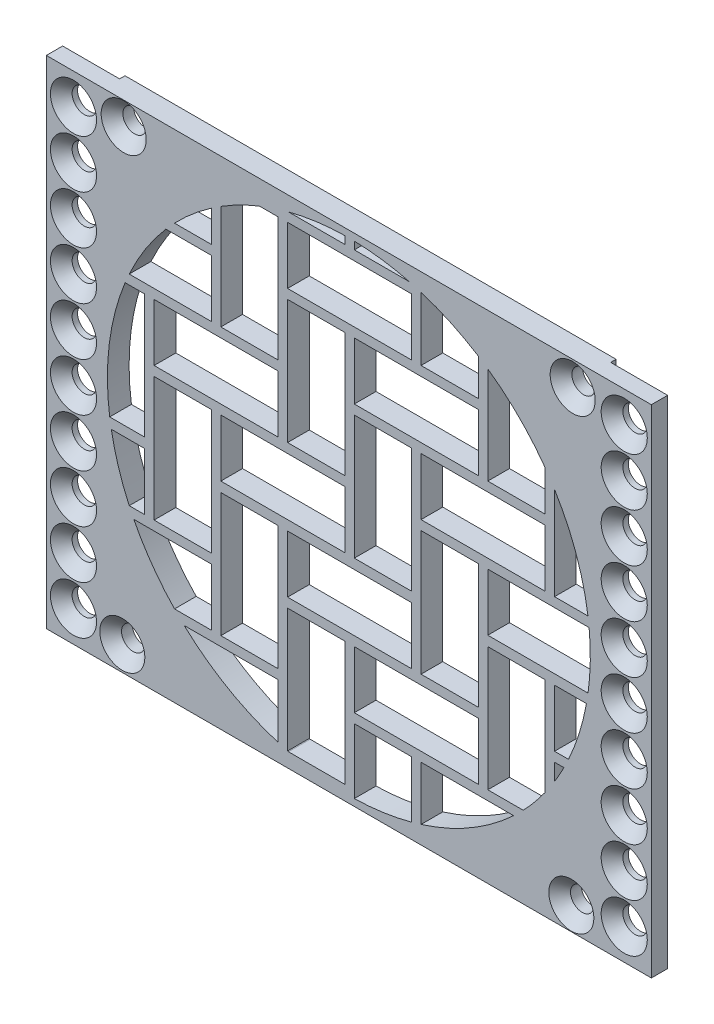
from build123d import *

# Parameters (mm, degrees)
SKETCH1_W           = 111.5
SKETCH1_H           = 91.5
SKETCH1_R           = 2.15
SKETCH1_R_2         = 44.5
SKETCH1_R_3         = 2.25
BOSS_EXTRUDE1_DEPTH = 4
SKETCH2_W           = 10.55131
SKETCH2_H           = 22.92178
SKETCH2_W_2         = 22.85108
SKETCH2_H_2         = 10.55145
SKETCH2_W_3         = 22.85101
SKETCH2_H_3         = 22.85094
SKETCH2_W_4         = 10.55145
SKETCH2_H_4         = 22.85122
SKETCH2_H_5         = 10.55117
BOSS_EXTRUDE2_DEPTH = 4
SKETCH3_W           = 10.5
SKETCH3_H           = 91.5
CUT_EXTRUDE1_DEPTH  = 1
CHAMFER1_SIZE       = 2


with BuildPart() as part:
    # Sketch1 → Boss-Extrude1 (new body)
    with BuildSketch(Plane.XY):
        with Locations((-1.831147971, 0)):
            Rectangle(SKETCH1_W, SKETCH1_H)
        with Locations((39.418852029, 41.25)):
            Circle(SKETCH1_R, mode=Mode.SUBTRACT)
        with Locations((39.168852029, -41.5)):
            Circle(SKETCH1_R, mode=Mode.SUBTRACT)
        with Locations((-43.581147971, -41.25)):
            Circle(SKETCH1_R, mode=Mode.SUBTRACT)
        with Locations((-43.331147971, 41.5)):
            Circle(SKETCH1_R, mode=Mode.SUBTRACT)
        with Locations((-1.831147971, 0)):
            Circle(SKETCH1_R_2, mode=Mode.SUBTRACT)
        with Locations((-52.581147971, -40.05)):
            Circle(SKETCH1_R_3, mode=Mode.SUBTRACT)
        with Locations((-52.581147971, -31.15)):
            Circle(SKETCH1_R_3, mode=Mode.SUBTRACT)
        with Locations((-52.581147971, -22.25)):
            Circle(SKETCH1_R_3, mode=Mode.SUBTRACT)
        with Locations((-52.581147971, -13.35)):
            Circle(SKETCH1_R_3, mode=Mode.SUBTRACT)
        with Locations((-52.581147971, -4.45)):
            Circle(SKETCH1_R_3, mode=Mode.SUBTRACT)
        with Locations((-52.581147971, 4.45)):
            Circle(SKETCH1_R_3, mode=Mode.SUBTRACT)
        with Locations((-52.581147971, 13.35)):
            Circle(SKETCH1_R_3, mode=Mode.SUBTRACT)
        with Locations((-52.581147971, 22.25)):
            Circle(SKETCH1_R_3, mode=Mode.SUBTRACT)
        with Locations((-52.581147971, 31.15)):
            Circle(SKETCH1_R_3, mode=Mode.SUBTRACT)
        with Locations((-52.581147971, 40.05)):
            Circle(SKETCH1_R_3, mode=Mode.SUBTRACT)
        with Locations(Location((48.918852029, 40.05, 0), (0, 0, 180))):
            Circle(SKETCH1_R_3, mode=Mode.SUBTRACT)
        with Locations(Location((48.918852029, 31.15, 0), (0, 0, 180))):
            Circle(SKETCH1_R_3, mode=Mode.SUBTRACT)
        with Locations(Location((48.918852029, 22.25, 0), (0, 0, 180))):
            Circle(SKETCH1_R_3, mode=Mode.SUBTRACT)
        with Locations(Location((48.918852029, 13.35, 0), (0, 0, 180))):
            Circle(SKETCH1_R_3, mode=Mode.SUBTRACT)
        with Locations(Location((48.918852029, 4.45, 0), (0, 0, 180))):
            Circle(SKETCH1_R_3, mode=Mode.SUBTRACT)
        with Locations(Location((48.918852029, -4.45, 0), (0, 0, 180))):
            Circle(SKETCH1_R_3, mode=Mode.SUBTRACT)
        with Locations(Location((48.918852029, -13.35, 0), (0, 0, 180))):
            Circle(SKETCH1_R_3, mode=Mode.SUBTRACT)
        with Locations(Location((48.918852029, -22.25, 0), (0, 0, 180))):
            Circle(SKETCH1_R_3, mode=Mode.SUBTRACT)
        with Locations(Location((48.918852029, -31.15, 0), (0, 0, 180))):
            Circle(SKETCH1_R_3, mode=Mode.SUBTRACT)
        with Locations(Location((48.918852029, -40.05, 0), (0, 0, 180))):
            Circle(SKETCH1_R_3, mode=Mode.SUBTRACT)
    extrude(amount=BOSS_EXTRUDE1_DEPTH)

    # Sketch2 → Boss-Extrude2 (add)
    with BuildSketch(Plane.XY):
        with BuildLine():
            Line((36.070362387, -7.93345), (41.955954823, -7.93345))
            ThreePointArc((41.955954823, -7.93345), (42.110786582, -7.025410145), (42.246789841, -6.11436))
            Line((42.246789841, -6.11436), (23.770662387, -6.11436))
            Line((23.770662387, -6.11436), (23.770662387, 4.43681))
            Line((23.770662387, 4.43681), (42.44711664, 4.43681))
            ThreePointArc((42.44711664, 4.43681), (42.35066448, 5.312009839), (42.236914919, 6.18513))
            Line((42.236914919, 6.18513), (36.070362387, 6.18513))
            Line((36.070362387, 6.18513), (36.070362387, 23.317922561))
            ThreePointArc((36.070362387, 23.317922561), (35.219478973, 24.647536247), (34.321972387, 25.946134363))
            Line((34.321972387, 25.946134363), (34.321972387, 18.4849))
            Line((34.321972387, 18.4849), (23.770662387, 18.4849))
            Line((23.770662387, 18.4849), (23.770662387, 36.397765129))
            ThreePointArc((23.770662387, 36.397765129), (22.90340935, 36.992589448), (22.022342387, 37.566753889))
            Line((22.022342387, 37.566753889), (22.022342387, 30.78467))
            Line((22.022342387, 30.78467), (11.470962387, 30.78467))
            Line((11.470962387, 30.78467), (11.470962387, 42.465325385))
            ThreePointArc((11.470962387, 42.465325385), (10.391166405, 42.788608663), (9.303528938, 43.08444))
            Line((9.303528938, 43.08444), (-0.828667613, 43.08444))
            Line((-0.828667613, 43.08444), (-0.828667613, 44.488706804))
            ThreePointArc((-0.828667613, 44.488706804), (-1.702837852, 44.499815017), (-2.577057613, 44.493748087))
            Line((-2.577057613, 44.493748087), (-2.577057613, 43.08444))
            Line((-2.577057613, 43.08444), (-12.965824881, 43.08444))
            ThreePointArc((-12.965824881, 43.08444), (-15.665900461, 42.294794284), (-18.310686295, 41.33612))
            Line((-18.310686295, 41.33612), (-14.876827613, 41.33612))
            Line((-14.876827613, 41.33612), (-14.876827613, 18.4849))
            Line((-14.876827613, 18.4849), (-25.428137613, 18.4849))
            Line((-25.428137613, 18.4849), (-25.428137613, 37.728398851))
            ThreePointArc((-25.428137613, 37.728398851), (-26.309070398, 37.162902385), (-27.176457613, 36.576840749))
            Line((-27.176457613, 36.576840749), (-27.176457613, 30.78467))
            Line((-27.176457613, 30.78467), (-33.964527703, 30.78467))
            ThreePointArc((-33.964527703, 30.78467), (-34.770195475, 29.921048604), (-35.552660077, 29.03635))
            Line((-35.552660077, 29.03635), (-27.176457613, 29.03635))
            Line((-27.176457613, 29.03635), (-27.176457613, 18.4849))
            Line((-27.176457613, 18.4849), (-42.310259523, 18.4849))
            ThreePointArc((-42.310259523, 18.4849), (-42.696412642, 17.614770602), (-43.063864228, 16.73658))
            Line((-43.063864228, 16.73658), (-39.476227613, 16.73658))
            Line((-39.476227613, 16.73658), (-39.476227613, -6.11436))
            Line((-39.476227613, -6.11436), (-45.909085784, -6.11436))
            ThreePointArc((-45.909085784, -6.11436), (-45.773076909, -7.025445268), (-45.618238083, -7.93352))
            Line((-45.618238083, -7.93352), (-39.476227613, -7.93352))
            Line((-39.476227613, -7.93352), (-39.476227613, -18.48497))
            Line((-39.476227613, -18.48497), (-42.310227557, -18.48497))
            ThreePointArc((-42.310227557, -18.48497), (-41.897288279, -19.36373933), (-41.465274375, -20.23329))
            Line((-41.465274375, -20.23329), (-27.176597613, -20.23329))
            Line((-27.176597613, -20.23329), (-27.176597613, -30.78474))
            Line((-27.176597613, -30.78474), (-33.964460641, -30.78474))
            ThreePointArc((-33.964460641, -30.78474), (-33.091020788, -31.671285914), (-32.193130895, -32.53306))
            Line((-32.193130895, -32.53306), (-14.876827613, -32.53306))
            Line((-14.876827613, -32.53306), (-14.876827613, -42.544802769))
            ThreePointArc((-14.876827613, -42.544802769), (-14.005206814, -42.802363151), (-13.128507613, -43.042068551))
            Line((-13.128507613, -43.042068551), (-13.128507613, -20.23322))
            Line((-13.128507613, -20.23322), (-2.577057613, -20.23322))
            Line((-2.577057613, -20.23322), (-2.577057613, -43.08423))
            Line((-2.577057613, -43.08423), (-12.966637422, -43.08423))
            ThreePointArc((-12.966637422, -43.08423), (-6.946122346, -44.205056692), (-0.828737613, -44.488708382))
            Line((-0.828737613, -44.488708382), (-0.828737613, -32.53306))
            Line((-0.828737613, -32.53306), (9.722572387, -32.53306))
            Line((9.722572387, -32.53306), (9.722572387, -42.973963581))
            ThreePointArc((9.722572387, -42.973963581), (10.599369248, -42.728588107), (11.470962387, -42.465325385))
            Line((11.470962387, -42.465325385), (11.470962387, -32.53306))
            Line((11.470962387, -32.53306), (28.530834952, -32.53306))
            ThreePointArc((28.530834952, -32.53306), (29.428724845, -31.671285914), (30.302164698, -30.78474))
            Line((30.302164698, -30.78474), (23.770662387, -30.78474))
            Line((23.770662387, -30.78474), (23.770662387, -7.93345))
            Line((23.770662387, -7.93345), (30.995922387, -7.93345))
            Line((30.995922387, -7.93345), (34.322042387, -7.93345))
            Line((34.322042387, -7.93345), (34.322042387, -25.946036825))
            ThreePointArc((34.322042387, -25.946036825), (35.219512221, -24.647486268), (36.070362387, -23.317922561))
            Line((36.070362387, -23.317922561), (36.070362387, -20.23329))
            Line((36.070362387, -20.23329), (37.802978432, -20.23329))
            ThreePointArc((37.802978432, -20.23329), (38.235009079, -19.363704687), (38.64796358, -18.4849))
            Line((38.64796358, -18.4849), (36.070362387, -18.4849))
            Line((36.070362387, -18.4849), (36.070362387, -7.93345))
        make_face()
        Polygon((-25.428277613, -7.93345), (-25.428137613, -30.78474), (-14.876827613, -30.78474), (-14.876827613, -7.93345), align=None, mode=Mode.SUBTRACT)
        with Locations((-32.452252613, -7.02408)):
            Rectangle(SKETCH2_W, SKETCH2_H, mode=Mode.SUBTRACT)
        with Locations((-1.702897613, 36.060395)):
            Rectangle(SKETCH2_W_2, SKETCH2_H_2, mode=Mode.SUBTRACT)
        with Locations((22.896467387, 11.460855)):
            Rectangle(SKETCH2_W_3, SKETCH2_H_2, mode=Mode.SUBTRACT)
        with Locations((10.596802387, -25.508945)):
            Rectangle(SKETCH2_W_2, SKETCH2_H_2, mode=Mode.SUBTRACT)
        with Locations((4.446987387, 5.31111)):
            Rectangle(SKETCH2_W, SKETCH2_H_3, mode=Mode.SUBTRACT)
        Polygon((11.470962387, 4.43681), (22.022412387, 4.43681), (22.022412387, -6.98859), (22.022412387, -18.48497), (11.470962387, -18.48497), (11.470962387, -6.98859), align=None, mode=Mode.SUBTRACT)
        with Locations((10.596872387, 23.760625)):
            Rectangle(SKETCH2_W_2, SKETCH2_H_2, mode=Mode.SUBTRACT)
        with Locations((-1.702967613, -13.209175)):
            Rectangle(SKETCH2_W_2, SKETCH2_H_2, mode=Mode.SUBTRACT)
        with Locations((-7.852782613, 17.61074)):
            Rectangle(SKETCH2_W_4, SKETCH2_H_4, mode=Mode.SUBTRACT)
        with Locations((-14.002597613, -0.838775)):
            Rectangle(SKETCH2_W_2, SKETCH2_H_5, mode=Mode.SUBTRACT)
        with Locations((-26.302367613, 11.460855)):
            Rectangle(SKETCH2_W_2, SKETCH2_H_2, mode=Mode.SUBTRACT)
    extrude(amount=BOSS_EXTRUDE2_DEPTH)

    # Sketch3 → Cut-Extrude1 (cut)
    with BuildSketch(Plane.XY):
        with Locations((-52.331147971, 0)):
            Rectangle(SKETCH3_W, SKETCH3_H)
        with Locations((48.668852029, 0)):
            Rectangle(SKETCH3_W, SKETCH3_H)
    extrude(amount=CUT_EXTRUDE1_DEPTH, mode=Mode.SUBTRACT)

    # Chamfer1
    chamfer1_edges = [part.edges().sort_by_distance(p)[0] for p in [
        (51.168852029, -31.15, 4),
        (51.168852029, -40.05, 4),
        (37.268852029, 41.25, 4),
        (37.018852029, -41.5, 4),
        (-45.731147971, -41.25, 4),
        (-45.481147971, 41.5, 4),
        (51.168852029, 40.05, 4),
        (51.168852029, 31.15, 4),
        (51.168852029, 22.25, 4),
        (51.168852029, 13.35, 4),
        (51.168852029, 4.45, 4),
        (51.168852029, -4.45, 4),
        (51.168852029, -13.35, 4),
        (-54.831147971, -40.05, 4),
        (-54.831147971, -31.15, 4),
        (-54.831147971, -22.25, 4),
        (-54.831147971, -13.35, 4),
        (-54.831147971, -4.45, 4),
        (-54.831147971, 4.45, 4),
        (-54.831147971, 13.35, 4),
        (-54.831147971, 22.25, 4),
        (-54.831147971, 31.15, 4),
        (-54.831147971, 40.05, 4),
        (51.168852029, -22.25, 4),
    ]]
    chamfer(chamfer1_edges, length=CHAMFER1_SIZE)


solid = part.part
